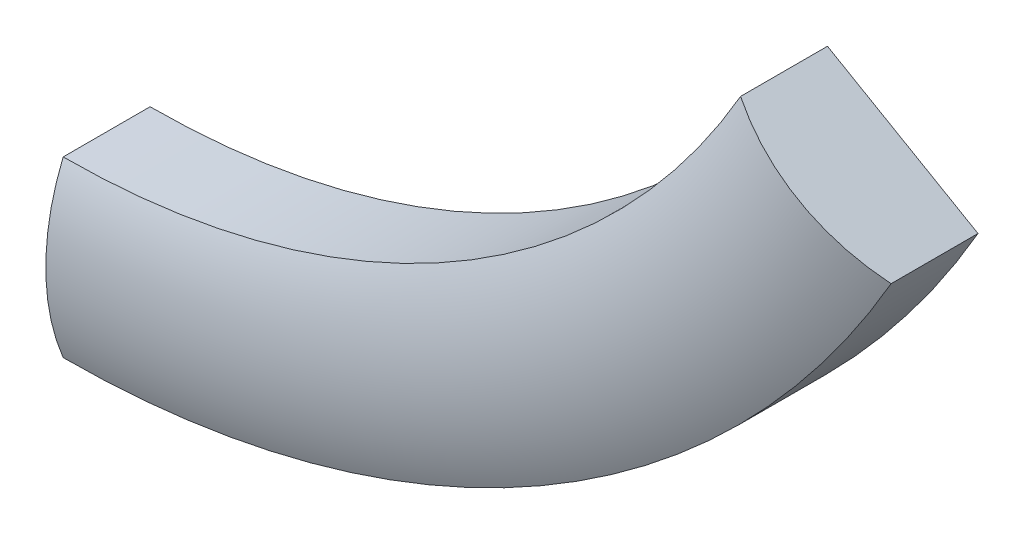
ISO-10303-21;
HEADER;
FILE_DESCRIPTION(('STEP AP214'),'2;1');
FILE_NAME('part.step','',(''),(''),'','','');
FILE_SCHEMA(('AUTOMOTIVE_DESIGN { 1 0 10303 214 1 1 1 1 }'));
ENDSEC;
DATA;
#1=APPLICATION_CONTEXT('core data for automotive mechanical design processes');
#2=APPLICATION_PROTOCOL_DEFINITION('international standard','automotive_design',2000,#1);
#3=PRODUCT_CONTEXT('',#1,'mechanical');
#4=PRODUCT('Part','Part','',(#3));
#5=PRODUCT_RELATED_PRODUCT_CATEGORY('part','',(#4));
#6=PRODUCT_DEFINITION_FORMATION('','',#4);
#7=PRODUCT_DEFINITION_CONTEXT('part definition',#1,'design');
#8=PRODUCT_DEFINITION('design','',#6,#7);
#9=PRODUCT_DEFINITION_SHAPE('','',#8);
#10=(LENGTH_UNIT() NAMED_UNIT(*) SI_UNIT(.MILLI.,.METRE.));
#11=(NAMED_UNIT(*) PLANE_ANGLE_UNIT() SI_UNIT($,.RADIAN.));
#12=(NAMED_UNIT(*) SI_UNIT($,.STERADIAN.) SOLID_ANGLE_UNIT());
#13=UNCERTAINTY_MEASURE_WITH_UNIT(LENGTH_MEASURE(1.E-05),#10,'distance_accuracy_value','');
#14=(GEOMETRIC_REPRESENTATION_CONTEXT(3) GLOBAL_UNCERTAINTY_ASSIGNED_CONTEXT((#13)) GLOBAL_UNIT_ASSIGNED_CONTEXT((#10,
#11,#12)) REPRESENTATION_CONTEXT('',''));
#15=CARTESIAN_POINT('',(0.,0.,0.));
#16=DIRECTION('',(0.,0.,1.));
#17=DIRECTION('',(1.,0.,0.));
#18=AXIS2_PLACEMENT_3D('',#15,#16,#17);
#19=CARTESIAN_POINT('',(-866.02540378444,-550.000000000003,0.));
#20=DIRECTION('',(0.,0.,1.));
#21=DIRECTION('',(1.,0.,0.));
#22=AXIS2_PLACEMENT_3D('',#19,#20,#21);
#23=PLANE('',#22);
#24=CARTESIAN_POINT('',(-448.368333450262,-263.600509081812,0.));
#25=DIRECTION('',(0.,0.,1.));
#26=DIRECTION('',(1.,0.,0.));
#27=AXIS2_PLACEMENT_3D('',#24,#25,#26);
#28=CIRCLE('',#27,0.0499999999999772);
#29=CARTESIAN_POINT('',(-448.318333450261,-263.600509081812,0.));
#30=VERTEX_POINT('',#29);
#31=EDGE_CURVE('E11',#30,#30,#28,.F.);
#32=ORIENTED_EDGE('',*,*,#31,.F.);
#33=EDGE_LOOP('',(#32));
#34=FACE_BOUND('',#33,.T.);
#35=DIRECTION('',(0.,1.,0.));
#36=VECTOR('',#35,1.);
#37=CARTESIAN_POINT('',(-866.025403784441,-371.246596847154,0.));
#38=LINE('',#37,#36);
#39=CARTESIAN_POINT('',(-866.02540378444,-550.000000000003,0.));
#40=VERTEX_POINT('',#39);
#41=CARTESIAN_POINT('',(-866.025403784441,-450.000000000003,0.));
#42=VERTEX_POINT('',#41);
#43=EDGE_CURVE('E46',#40,#42,#38,.T.);
#44=ORIENTED_EDGE('',*,*,#43,.T.);
#45=CARTESIAN_POINT('',(-866.02540378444,-2.42861286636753E-12,0.));
#46=DIRECTION('',(0.,0.,1.));
#47=DIRECTION('',(1.,0.,0.));
#48=AXIS2_PLACEMENT_3D('',#45,#46,#47);
#49=CIRCLE('',#48,450.);
#50=CARTESIAN_POINT('',(-476.313972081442,-225.000000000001,0.));
#51=VERTEX_POINT('',#50);
#52=EDGE_CURVE('E82',#42,#51,#49,.T.);
#53=ORIENTED_EDGE('',*,*,#52,.T.);
#54=DIRECTION('',(0.86602540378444,-0.499999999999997,0.));
#55=VECTOR('',#54,1.);
#56=CARTESIAN_POINT('',(-389.711431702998,-275.000000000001,0.));
#57=LINE('',#56,#55);
#58=CARTESIAN_POINT('',(-389.711431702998,-275.000000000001,0.));
#59=VERTEX_POINT('',#58);
#60=EDGE_CURVE('E100',#51,#59,#57,.T.);
#61=ORIENTED_EDGE('',*,*,#60,.T.);
#62=CARTESIAN_POINT('',(-866.02540378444,-2.42861286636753E-12,0.));
#63=DIRECTION('',(0.,0.,1.));
#64=DIRECTION('',(1.,0.,0.));
#65=AXIS2_PLACEMENT_3D('',#62,#63,#64);
#66=CIRCLE('',#65,550.);
#67=EDGE_CURVE('E84',#40,#59,#66,.T.);
#68=ORIENTED_EDGE('',*,*,#67,.F.);
#69=EDGE_LOOP('',(#44,#53,#61,#68));
#70=FACE_BOUND('',#69,.T.);
#71=ADVANCED_FACE('F31',(#34,#70),#23,.F.);
#72=CARTESIAN_POINT('',(-866.02540378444,-2.44249065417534E-12,-70.));
#73=DIRECTION('',(0.,0.,1.));
#74=DIRECTION('',(1.,0.,0.));
#75=AXIS2_PLACEMENT_3D('',#72,#73,#74);
#76=TOROIDAL_SURFACE('',#75,500.,130.);
#77=CARTESIAN_POINT('',(-866.02540378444,-2.42861286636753E-12,50.));
#78=DIRECTION('',(0.,0.,1.));
#79=DIRECTION('',(1.,0.,0.));
#80=AXIS2_PLACEMENT_3D('',#77,#78,#79);
#81=CIRCLE('',#80,450.);
#82=CARTESIAN_POINT('',(-866.02540378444,-450.000000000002,50.));
#83=VERTEX_POINT('',#82);
#84=CARTESIAN_POINT('',(-476.313972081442,-225.000000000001,50.));
#85=VERTEX_POINT('',#84);
#86=EDGE_CURVE('E39',#83,#85,#81,.T.);
#87=ORIENTED_EDGE('',*,*,#86,.F.);
#88=CARTESIAN_POINT('',(-866.02540378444,-500.000000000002,-70.));
#89=DIRECTION('',(-1.,0.,0.));
#90=DIRECTION('',(0.,-1.,0.));
#91=AXIS2_PLACEMENT_3D('',#88,#89,#90);
#92=CIRCLE('',#91,130.);
#93=CARTESIAN_POINT('',(-866.025403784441,-550.000000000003,50.));
#94=VERTEX_POINT('',#93);
#95=EDGE_CURVE('E74',#94,#83,#92,.T.);
#96=ORIENTED_EDGE('',*,*,#95,.F.);
#97=CARTESIAN_POINT('',(-866.02540378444,-2.42861286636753E-12,50.));
#98=DIRECTION('',(0.,0.,1.));
#99=DIRECTION('',(1.,0.,0.));
#100=AXIS2_PLACEMENT_3D('',#97,#98,#99);
#101=CIRCLE('',#100,550.);
#102=CARTESIAN_POINT('',(-389.711431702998,-275.000000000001,50.));
#103=VERTEX_POINT('',#102);
#104=EDGE_CURVE('E54',#94,#103,#101,.T.);
#105=ORIENTED_EDGE('',*,*,#104,.T.);
#106=CARTESIAN_POINT('',(-433.01270189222,-250.000000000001,-70.));
#107=DIRECTION('',(-0.499999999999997,-0.86602540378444,0.));
#108=DIRECTION('',(0.86602540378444,-0.499999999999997,0.));
#109=AXIS2_PLACEMENT_3D('',#106,#107,#108);
#110=CIRCLE('',#109,130.);
#111=EDGE_CURVE('E103',#103,#85,#110,.T.);
#112=ORIENTED_EDGE('',*,*,#111,.T.);
#113=EDGE_LOOP('',(#87,#96,#105,#112));
#114=FACE_BOUND('',#113,.T.);
#115=ADVANCED_FACE('F118',(#114),#76,.T.);
#116=CARTESIAN_POINT('',(-866.02540378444,-2.42861286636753E-12,0.));
#117=DIRECTION('',(0.,0.,1.));
#118=DIRECTION('',(1.,0.,0.));
#119=AXIS2_PLACEMENT_3D('',#116,#117,#118);
#120=CYLINDRICAL_SURFACE('',#119,450.);
#121=ORIENTED_EDGE('',*,*,#52,.F.);
#122=DIRECTION('',(0.,0.,-1.));
#123=VECTOR('',#122,1.);
#124=CARTESIAN_POINT('',(-866.02540378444,-450.000000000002,50.));
#125=LINE('',#124,#123);
#126=EDGE_CURVE('E72',#83,#42,#125,.T.);
#127=ORIENTED_EDGE('',*,*,#126,.F.);
#128=ORIENTED_EDGE('',*,*,#86,.T.);
#129=DIRECTION('',(0.,0.,-1.));
#130=VECTOR('',#129,1.);
#131=CARTESIAN_POINT('',(-476.313972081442,-225.000000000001,50.));
#132=LINE('',#131,#130);
#133=EDGE_CURVE('E89',#85,#51,#132,.T.);
#134=ORIENTED_EDGE('',*,*,#133,.T.);
#135=EDGE_LOOP('',(#121,#127,#128,#134));
#136=FACE_BOUND('',#135,.T.);
#137=ADVANCED_FACE('F33',(#136),#120,.F.);
#138=CARTESIAN_POINT('',(-866.02540378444,-2.42861286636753E-12,0.));
#139=DIRECTION('',(0.,0.,1.));
#140=DIRECTION('',(1.,0.,0.));
#141=AXIS2_PLACEMENT_3D('',#138,#139,#140);
#142=CYLINDRICAL_SURFACE('',#141,550.);
#143=DIRECTION('',(0.,0.,1.));
#144=VECTOR('',#143,1.);
#145=CARTESIAN_POINT('',(-866.02540378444,-550.000000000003,50.));
#146=LINE('',#145,#144);
#147=EDGE_CURVE('E78',#40,#94,#146,.T.);
#148=ORIENTED_EDGE('',*,*,#147,.F.);
#149=ORIENTED_EDGE('',*,*,#67,.T.);
#150=DIRECTION('',(0.,0.,1.));
#151=VECTOR('',#150,1.);
#152=CARTESIAN_POINT('',(-389.711431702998,-275.000000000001,50.));
#153=LINE('',#152,#151);
#154=EDGE_CURVE('E97',#59,#103,#153,.T.);
#155=ORIENTED_EDGE('',*,*,#154,.T.);
#156=ORIENTED_EDGE('',*,*,#104,.F.);
#157=EDGE_LOOP('',(#148,#149,#155,#156));
#158=FACE_BOUND('',#157,.T.);
#159=ADVANCED_FACE('F124',(#158),#142,.T.);
#160=CARTESIAN_POINT('',(-433.01270189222,-250.000000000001,-70.));
#161=DIRECTION('',(-0.499999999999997,-0.86602540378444,0.));
#162=DIRECTION('',(0.86602540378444,-0.499999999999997,0.));
#163=AXIS2_PLACEMENT_3D('',#160,#161,#162);
#164=PLANE('',#163);
#165=ORIENTED_EDGE('',*,*,#111,.F.);
#166=ORIENTED_EDGE('',*,*,#154,.F.);
#167=ORIENTED_EDGE('',*,*,#60,.F.);
#168=ORIENTED_EDGE('',*,*,#133,.F.);
#169=EDGE_LOOP('',(#165,#166,#167,#168));
#170=FACE_BOUND('',#169,.T.);
#171=ADVANCED_FACE('F113',(#170),#164,.F.);
#172=CARTESIAN_POINT('',(-448.368333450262,-263.600509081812,-0.1));
#173=DIRECTION('',(0.,0.,1.));
#174=DIRECTION('',(1.,0.,0.));
#175=AXIS2_PLACEMENT_3D('',#172,#173,#174);
#176=CYLINDRICAL_SURFACE('',#175,0.0499999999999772);
#177=CARTESIAN_POINT('',(-448.368333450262,-263.600509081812,-0.1));
#178=DIRECTION('',(0.,0.,-1.));
#179=DIRECTION('',(-1.,0.,0.));
#180=AXIS2_PLACEMENT_3D('',#177,#178,#179);
#181=CIRCLE('',#180,0.0499999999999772);
#182=CARTESIAN_POINT('',(-448.418333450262,-263.600509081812,-0.1));
#183=VERTEX_POINT('',#182);
#184=EDGE_CURVE('E86',#183,#183,#181,.T.);
#185=ORIENTED_EDGE('',*,*,#184,.F.);
#186=EDGE_LOOP('',(#185));
#187=FACE_BOUND('',#186,.T.);
#188=ORIENTED_EDGE('',*,*,#31,.T.);
#189=EDGE_LOOP('',(#188));
#190=FACE_BOUND('',#189,.T.);
#191=ADVANCED_FACE('F110',(#187,#190),#176,.T.);
#192=CARTESIAN_POINT('',(-448.368333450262,-263.600509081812,-0.1));
#193=DIRECTION('',(0.,0.,-1.));
#194=DIRECTION('',(-1.,0.,0.));
#195=AXIS2_PLACEMENT_3D('',#192,#193,#194);
#196=PLANE('',#195);
#197=ORIENTED_EDGE('',*,*,#184,.T.);
#198=EDGE_LOOP('',(#197));
#199=FACE_BOUND('',#198,.T.);
#200=ADVANCED_FACE('F108',(#199),#196,.T.);
#201=CARTESIAN_POINT('',(-866.025403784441,-450.000000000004,0.));
#202=DIRECTION('',(-1.,0.,0.));
#203=DIRECTION('',(0.,-1.,0.));
#204=AXIS2_PLACEMENT_3D('',#201,#202,#203);
#205=PLANE('',#204);
#206=ORIENTED_EDGE('',*,*,#126,.T.);
#207=ORIENTED_EDGE('',*,*,#43,.F.);
#208=ORIENTED_EDGE('',*,*,#147,.T.);
#209=ORIENTED_EDGE('',*,*,#95,.T.);
#210=EDGE_LOOP('',(#206,#207,#208,#209));
#211=FACE_BOUND('',#210,.T.);
#212=ADVANCED_FACE('F73',(#211),#205,.T.);
#213=CLOSED_SHELL('',(#71,#115,#137,#159,#171,#191,#200,#212));
#214=MANIFOLD_SOLID_BREP('B2',#213);
#215=ADVANCED_BREP_SHAPE_REPRESENTATION('',(#18,#214),#14);
#216=SHAPE_DEFINITION_REPRESENTATION(#9,#215);
ENDSEC;
END-ISO-10303-21;
